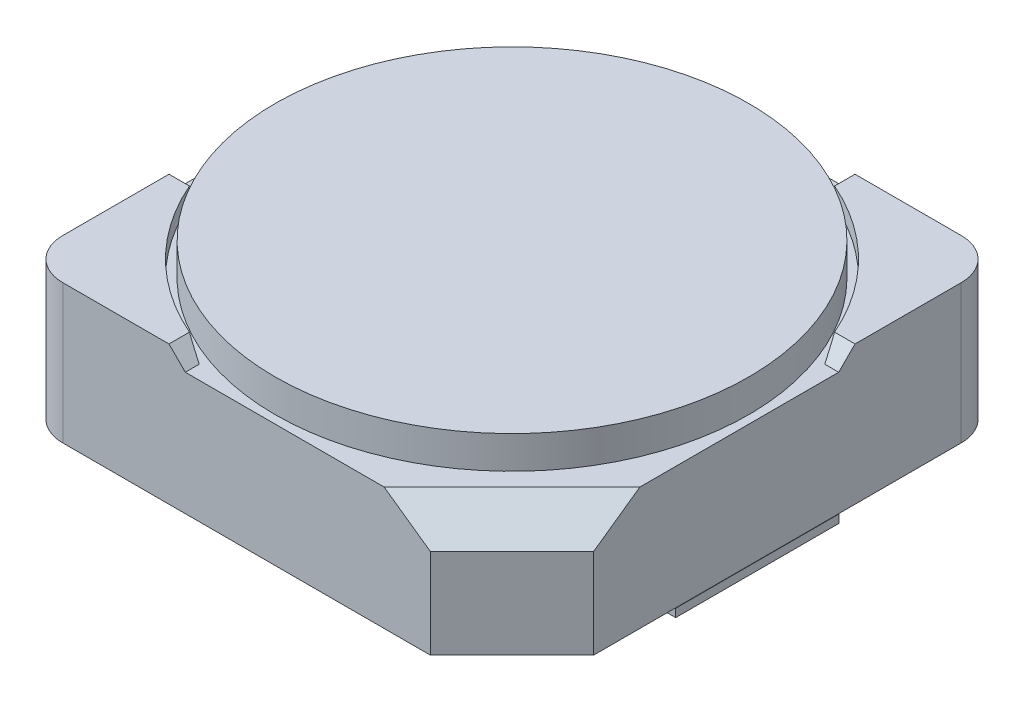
ISO-10303-21;
HEADER;
FILE_DESCRIPTION(('STEP AP214'),'2;1');
FILE_NAME('part.step','',(''),(''),'','','');
FILE_SCHEMA(('AUTOMOTIVE_DESIGN { 1 0 10303 214 1 1 1 1 }'));
ENDSEC;
DATA;
#1=APPLICATION_CONTEXT('core data for automotive mechanical design processes');
#2=APPLICATION_PROTOCOL_DEFINITION('international standard','automotive_design',2000,#1);
#3=PRODUCT_CONTEXT('',#1,'mechanical');
#4=PRODUCT('Part','Part','',(#3));
#5=PRODUCT_RELATED_PRODUCT_CATEGORY('part','',(#4));
#6=PRODUCT_DEFINITION_FORMATION('','',#4);
#7=PRODUCT_DEFINITION_CONTEXT('part definition',#1,'design');
#8=PRODUCT_DEFINITION('design','',#6,#7);
#9=PRODUCT_DEFINITION_SHAPE('','',#8);
#10=(LENGTH_UNIT() NAMED_UNIT(*) SI_UNIT(.MILLI.,.METRE.));
#11=(NAMED_UNIT(*) PLANE_ANGLE_UNIT() SI_UNIT($,.RADIAN.));
#12=(NAMED_UNIT(*) SI_UNIT($,.STERADIAN.) SOLID_ANGLE_UNIT());
#13=UNCERTAINTY_MEASURE_WITH_UNIT(LENGTH_MEASURE(1.E-05),#10,'distance_accuracy_value','');
#14=(GEOMETRIC_REPRESENTATION_CONTEXT(3) GLOBAL_UNCERTAINTY_ASSIGNED_CONTEXT((#13)) GLOBAL_UNIT_ASSIGNED_CONTEXT((#10,
#11,#12)) REPRESENTATION_CONTEXT('',''));
#15=CARTESIAN_POINT('',(0.,0.,0.));
#16=DIRECTION('',(0.,0.,1.));
#17=DIRECTION('',(1.,0.,0.));
#18=AXIS2_PLACEMENT_3D('',#15,#16,#17);
#19=CARTESIAN_POINT('',(0.00229122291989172,1.6,0.));
#20=DIRECTION('',(0.,1.,0.));
#21=DIRECTION('',(0.,0.,1.));
#22=AXIS2_PLACEMENT_3D('',#19,#20,#21);
#23=PLANE('',#22);
#24=CARTESIAN_POINT('',(0.,1.6,0.));
#25=DIRECTION('',(0.,1.,0.));
#26=DIRECTION('',(0.,0.,1.));
#27=AXIS2_PLACEMENT_3D('',#24,#25,#26);
#28=CIRCLE('',#27,2.9);
#29=CARTESIAN_POINT('',(0.,1.6,2.9));
#30=VERTEX_POINT('',#29);
#31=EDGE_CURVE('E272',#30,#30,#28,.T.);
#32=ORIENTED_EDGE('',*,*,#31,.F.);
#33=EDGE_LOOP('',(#32));
#34=FACE_BOUND('',#33,.T.);
#35=DIRECTION('',(0.,0.,-1.));
#36=VECTOR('',#35,1.);
#37=CARTESIAN_POINT('',(3.,1.6,2.));
#38=LINE('',#37,#36);
#39=CARTESIAN_POINT('',(3.,1.6,1.43431457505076));
#40=VERTEX_POINT('',#39);
#41=CARTESIAN_POINT('',(3.,1.6,-1.00000000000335));
#42=VERTEX_POINT('',#41);
#43=EDGE_CURVE('E284',#40,#42,#38,.T.);
#44=ORIENTED_EDGE('',*,*,#43,.T.);
#45=DIRECTION('',(1.,0.,-5.29548402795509E-13));
#46=VECTOR('',#45,1.);
#47=CARTESIAN_POINT('',(3.,1.6,-1.00000000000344));
#48=LINE('',#47,#46);
#49=CARTESIAN_POINT('',(2.82842712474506,1.6,-1.00000000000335));
#50=VERTEX_POINT('',#49);
#51=EDGE_CURVE('E246',#50,#42,#48,.T.);
#52=ORIENTED_EDGE('',*,*,#51,.F.);
#53=CARTESIAN_POINT('',(0.,1.6,0.));
#54=DIRECTION('',(0.,-1.,0.));
#55=DIRECTION('',(0.,0.,-1.));
#56=AXIS2_PLACEMENT_3D('',#53,#54,#55);
#57=CIRCLE('',#56,3.00000000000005);
#58=CARTESIAN_POINT('',(0.999999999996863,1.6,-2.82842712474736));
#59=VERTEX_POINT('',#58);
#60=EDGE_CURVE('E224',#59,#50,#57,.T.);
#61=ORIENTED_EDGE('',*,*,#60,.F.);
#62=DIRECTION('',(2.0663762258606E-12,0.,1.));
#63=VECTOR('',#62,1.);
#64=CARTESIAN_POINT('',(0.999999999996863,1.6,-2.82842712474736));
#65=LINE('',#64,#63);
#66=CARTESIAN_POINT('',(0.999999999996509,1.6,-3.));
#67=VERTEX_POINT('',#66);
#68=EDGE_CURVE('E249',#67,#59,#65,.T.);
#69=ORIENTED_EDGE('',*,*,#68,.F.);
#70=DIRECTION('',(-1.,0.,0.));
#71=VECTOR('',#70,1.);
#72=CARTESIAN_POINT('',(-2.,1.6,-3.));
#73=LINE('',#72,#71);
#74=CARTESIAN_POINT('',(-1.43431457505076,1.6,-3.));
#75=VERTEX_POINT('',#74);
#76=EDGE_CURVE('E275',#67,#75,#73,.T.);
#77=ORIENTED_EDGE('',*,*,#76,.T.);
#78=DIRECTION('',(-0.707106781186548,0.,0.707106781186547));
#79=VECTOR('',#78,1.);
#80=CARTESIAN_POINT('',(-2.71715728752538,1.6,-1.71715728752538));
#81=LINE('',#80,#79);
#82=CARTESIAN_POINT('',(-3.,1.6,-1.43431457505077));
#83=VERTEX_POINT('',#82);
#84=EDGE_CURVE('E402',#75,#83,#81,.T.);
#85=ORIENTED_EDGE('',*,*,#84,.T.);
#86=DIRECTION('',(0.,0.,1.));
#87=VECTOR('',#86,1.);
#88=CARTESIAN_POINT('',(-3.,1.6,2.5));
#89=LINE('',#88,#87);
#90=CARTESIAN_POINT('',(-3.,1.6,1.00000000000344));
#91=VERTEX_POINT('',#90);
#92=EDGE_CURVE('E279',#83,#91,#89,.T.);
#93=ORIENTED_EDGE('',*,*,#92,.T.);
#94=DIRECTION('',(-1.,0.,5.29548402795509E-13));
#95=VECTOR('',#94,1.);
#96=CARTESIAN_POINT('',(-3.,1.6,1.00000000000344));
#97=LINE('',#96,#95);
#98=CARTESIAN_POINT('',(-2.82842712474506,1.6,1.00000000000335));
#99=VERTEX_POINT('',#98);
#100=EDGE_CURVE('E245',#99,#91,#97,.T.);
#101=ORIENTED_EDGE('',*,*,#100,.F.);
#102=CARTESIAN_POINT('',(0.,1.6,0.));
#103=DIRECTION('',(0.,-1.,0.));
#104=DIRECTION('',(0.,0.,1.));
#105=AXIS2_PLACEMENT_3D('',#102,#103,#104);
#106=CIRCLE('',#105,3.00000000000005);
#107=CARTESIAN_POINT('',(-0.999999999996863,1.6,2.82842712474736));
#108=VERTEX_POINT('',#107);
#109=EDGE_CURVE('E256',#108,#99,#106,.T.);
#110=ORIENTED_EDGE('',*,*,#109,.F.);
#111=DIRECTION('',(-2.0663762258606E-12,0.,-1.));
#112=VECTOR('',#111,1.);
#113=CARTESIAN_POINT('',(-0.999999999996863,1.6,2.82842712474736));
#114=LINE('',#113,#112);
#115=CARTESIAN_POINT('',(-0.999999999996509,1.6,2.99999999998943));
#116=VERTEX_POINT('',#115);
#117=EDGE_CURVE('E268',#116,#108,#114,.T.);
#118=ORIENTED_EDGE('',*,*,#117,.F.);
#119=DIRECTION('',(1.,0.,0.));
#120=VECTOR('',#119,1.);
#121=CARTESIAN_POINT('',(-2.5,1.6,3.));
#122=LINE('',#121,#120);
#123=CARTESIAN_POINT('',(1.43431457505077,1.6,3.));
#124=VERTEX_POINT('',#123);
#125=EDGE_CURVE('E282',#116,#124,#122,.T.);
#126=ORIENTED_EDGE('',*,*,#125,.T.);
#127=DIRECTION('',(0.707106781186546,0.,-0.707106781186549));
#128=VECTOR('',#127,1.);
#129=CARTESIAN_POINT('',(2.71715728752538,1.6,1.71715728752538));
#130=LINE('',#129,#128);
#131=EDGE_CURVE('E392',#124,#40,#130,.T.);
#132=ORIENTED_EDGE('',*,*,#131,.T.);
#133=EDGE_LOOP('',(#44,#52,#61,#69,#77,#85,#93,#101,#110,#118,#126,#132));
#134=FACE_BOUND('',#133,.T.);
#135=ADVANCED_FACE('F36',(#34,#134),#23,.T.);
#136=CARTESIAN_POINT('',(3.,2.,2.));
#137=DIRECTION('',(-1.,0.,0.));
#138=DIRECTION('',(0.,0.,1.));
#139=AXIS2_PLACEMENT_3D('',#136,#137,#138);
#140=PLANE('',#139);
#141=DIRECTION('',(3.57873453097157E-12,0.,-1.));
#142=VECTOR('',#141,1.);
#143=CARTESIAN_POINT('',(3.00000000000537,1.8,-2.49999999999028));
#144=LINE('',#143,#142);
#145=CARTESIAN_POINT('',(3.00000000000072,1.8,-1.20000000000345));
#146=VERTEX_POINT('',#145);
#147=CARTESIAN_POINT('',(3.00000000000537,1.8,-2.49999999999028));
#148=VERTEX_POINT('',#147);
#149=EDGE_CURVE('E216',#146,#148,#144,.T.);
#150=ORIENTED_EDGE('',*,*,#149,.F.);
#151=DIRECTION('',(0.,-0.707106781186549,0.707106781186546));
#152=VECTOR('',#151,1.);
#153=CARTESIAN_POINT('',(3.,1.79999999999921,-1.20000000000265));
#154=LINE('',#153,#152);
#155=EDGE_CURVE('E427',#146,#42,#154,.T.);
#156=ORIENTED_EDGE('',*,*,#155,.T.);
#157=ORIENTED_EDGE('',*,*,#43,.F.);
#158=DIRECTION('',(0.,-0.577350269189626,0.816496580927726));
#159=VECTOR('',#158,1.);
#160=CARTESIAN_POINT('',(3.,1.23150445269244,1.95544597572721));
#161=LINE('',#160,#159);
#162=CARTESIAN_POINT('',(3.,1.2,2.));
#163=VERTEX_POINT('',#162);
#164=EDGE_CURVE('E395',#40,#163,#161,.T.);
#165=ORIENTED_EDGE('',*,*,#164,.T.);
#166=DIRECTION('',(0.,-1.,0.));
#167=VECTOR('',#166,1.);
#168=CARTESIAN_POINT('',(3.,2.,2.));
#169=LINE('',#168,#167);
#170=CARTESIAN_POINT('',(3.,0.1,2.));
#171=VERTEX_POINT('',#170);
#172=EDGE_CURVE('E234',#163,#171,#169,.T.);
#173=ORIENTED_EDGE('',*,*,#172,.T.);
#174=DIRECTION('',(0.,0.,1.));
#175=VECTOR('',#174,1.);
#176=CARTESIAN_POINT('',(3.,0.1,2.));
#177=LINE('',#176,#175);
#178=CARTESIAN_POINT('',(3.,0.1,1.00000000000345));
#179=VERTEX_POINT('',#178);
#180=EDGE_CURVE('E349',#179,#171,#177,.T.);
#181=ORIENTED_EDGE('',*,*,#180,.F.);
#182=CARTESIAN_POINT('',(3.,0.1,-1.00000000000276));
#183=VERTEX_POINT('',#182);
#184=EDGE_CURVE('E352',#183,#179,#177,.T.);
#185=ORIENTED_EDGE('',*,*,#184,.F.);
#186=CARTESIAN_POINT('',(3.,0.1,-2.5));
#187=VERTEX_POINT('',#186);
#188=EDGE_CURVE('E230',#187,#183,#177,.T.);
#189=ORIENTED_EDGE('',*,*,#188,.F.);
#190=DIRECTION('',(0.,-1.,0.));
#191=VECTOR('',#190,1.);
#192=CARTESIAN_POINT('',(3.,2.,-2.5));
#193=LINE('',#192,#191);
#194=EDGE_CURVE('E227',#148,#187,#193,.T.);
#195=ORIENTED_EDGE('',*,*,#194,.F.);
#196=EDGE_LOOP('',(#150,#156,#157,#165,#173,#181,#185,#189,#195));
#197=FACE_BOUND('',#196,.T.);
#198=ADVANCED_FACE('F228',(#197),#140,.F.);
#199=CARTESIAN_POINT('',(2.,2.,3.));
#200=DIRECTION('',(-0.707106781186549,0.,-0.707106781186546));
#201=DIRECTION('',(-0.707106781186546,0.,0.707106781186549));
#202=AXIS2_PLACEMENT_3D('',#199,#200,#201);
#203=PLANE('',#202);
#204=ORIENTED_EDGE('',*,*,#172,.F.);
#205=DIRECTION('',(-0.707106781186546,0.,0.707106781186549));
#206=VECTOR('',#205,1.);
#207=CARTESIAN_POINT('',(2.,1.2,3.));
#208=LINE('',#207,#206);
#209=CARTESIAN_POINT('',(2.,1.2,3.));
#210=VERTEX_POINT('',#209);
#211=EDGE_CURVE('E397',#163,#210,#208,.T.);
#212=ORIENTED_EDGE('',*,*,#211,.T.);
#213=DIRECTION('',(0.,-1.,0.));
#214=VECTOR('',#213,1.);
#215=CARTESIAN_POINT('',(2.,2.,3.));
#216=LINE('',#215,#214);
#217=CARTESIAN_POINT('',(2.,0.1,3.));
#218=VERTEX_POINT('',#217);
#219=EDGE_CURVE('E381',#210,#218,#216,.T.);
#220=ORIENTED_EDGE('',*,*,#219,.T.);
#221=DIRECTION('',(-0.707106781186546,0.,0.707106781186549));
#222=VECTOR('',#221,1.);
#223=CARTESIAN_POINT('',(2.,0.1,3.));
#224=LINE('',#223,#222);
#225=EDGE_CURVE('E351',#171,#218,#224,.T.);
#226=ORIENTED_EDGE('',*,*,#225,.F.);
#227=EDGE_LOOP('',(#204,#212,#220,#226));
#228=FACE_BOUND('',#227,.T.);
#229=ADVANCED_FACE('F493',(#228),#203,.F.);
#230=CARTESIAN_POINT('',(-2.5,2.,3.));
#231=DIRECTION('',(0.,0.,-1.));
#232=DIRECTION('',(-1.,0.,0.));
#233=AXIS2_PLACEMENT_3D('',#230,#231,#232);
#234=PLANE('',#233);
#235=ORIENTED_EDGE('',*,*,#125,.F.);
#236=DIRECTION('',(-0.707106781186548,0.707106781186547,0.));
#237=VECTOR('',#236,1.);
#238=CARTESIAN_POINT('',(-1.19999999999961,1.8000000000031,3.));
#239=LINE('',#238,#237);
#240=CARTESIAN_POINT('',(-1.19999999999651,1.8,2.99999999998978));
#241=VERTEX_POINT('',#240);
#242=EDGE_CURVE('E417',#116,#241,#239,.T.);
#243=ORIENTED_EDGE('',*,*,#242,.T.);
#244=DIRECTION('',(1.,0.,-1.76218993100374E-12));
#245=VECTOR('',#244,1.);
#246=CARTESIAN_POINT('',(-2.50000000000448,1.8,2.99999999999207));
#247=LINE('',#246,#245);
#248=CARTESIAN_POINT('',(-2.50000000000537,1.8,2.99999999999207));
#249=VERTEX_POINT('',#248);
#250=EDGE_CURVE('E259',#249,#241,#247,.T.);
#251=ORIENTED_EDGE('',*,*,#250,.F.);
#252=DIRECTION('',(0.,-1.,0.));
#253=VECTOR('',#252,1.);
#254=CARTESIAN_POINT('',(-2.5,2.,3.));
#255=LINE('',#254,#253);
#256=CARTESIAN_POINT('',(-2.5,0.1,3.));
#257=VERTEX_POINT('',#256);
#258=EDGE_CURVE('E383',#249,#257,#255,.T.);
#259=ORIENTED_EDGE('',*,*,#258,.T.);
#260=DIRECTION('',(-1.,0.,0.));
#261=VECTOR('',#260,1.);
#262=CARTESIAN_POINT('',(-2.5,0.1,3.));
#263=LINE('',#262,#261);
#264=EDGE_CURVE('E355',#218,#257,#263,.T.);
#265=ORIENTED_EDGE('',*,*,#264,.F.);
#266=ORIENTED_EDGE('',*,*,#219,.F.);
#267=DIRECTION('',(-0.816496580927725,0.577350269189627,0.));
#268=VECTOR('',#267,1.);
#269=CARTESIAN_POINT('',(1.95697345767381,1.23042435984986,3.));
#270=LINE('',#269,#268);
#271=EDGE_CURVE('E399',#210,#124,#270,.T.);
#272=ORIENTED_EDGE('',*,*,#271,.T.);
#273=EDGE_LOOP('',(#235,#243,#251,#259,#265,#266,#272));
#274=FACE_BOUND('',#273,.T.);
#275=ADVANCED_FACE('F478',(#274),#234,.F.);
#276=CARTESIAN_POINT('',(-2.5,2.,2.5));
#277=DIRECTION('',(0.,-1.,0.));
#278=DIRECTION('',(0.,0.,-1.));
#279=AXIS2_PLACEMENT_3D('',#276,#277,#278);
#280=CYLINDRICAL_SURFACE('',#279,0.5);
#281=ORIENTED_EDGE('',*,*,#258,.F.);
#282=CARTESIAN_POINT('',(-2.50000000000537,1.8,2.49999999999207));
#283=DIRECTION('',(0.,1.,0.));
#284=DIRECTION('',(0.,0.,1.));
#285=AXIS2_PLACEMENT_3D('',#282,#283,#284);
#286=CIRCLE('',#285,0.5);
#287=CARTESIAN_POINT('',(-3.00000000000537,1.8,2.49999999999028));
#288=VERTEX_POINT('',#287);
#289=EDGE_CURVE('E255',#288,#249,#286,.T.);
#290=ORIENTED_EDGE('',*,*,#289,.F.);
#291=DIRECTION('',(0.,-1.,0.));
#292=VECTOR('',#291,1.);
#293=CARTESIAN_POINT('',(-3.,2.,2.5));
#294=LINE('',#293,#292);
#295=CARTESIAN_POINT('',(-3.,0.1,2.5));
#296=VERTEX_POINT('',#295);
#297=EDGE_CURVE('E385',#288,#296,#294,.T.);
#298=ORIENTED_EDGE('',*,*,#297,.T.);
#299=CARTESIAN_POINT('',(-2.5,0.1,2.5));
#300=DIRECTION('',(0.,-1.,0.));
#301=DIRECTION('',(0.,0.,-1.));
#302=AXIS2_PLACEMENT_3D('',#299,#300,#301);
#303=CIRCLE('',#302,0.5);
#304=EDGE_CURVE('E358',#257,#296,#303,.T.);
#305=ORIENTED_EDGE('',*,*,#304,.F.);
#306=EDGE_LOOP('',(#281,#290,#298,#305));
#307=FACE_BOUND('',#306,.T.);
#308=ADVANCED_FACE('F481',(#307),#280,.T.);
#309=CARTESIAN_POINT('',(-3.,2.,2.5));
#310=DIRECTION('',(1.,0.,0.));
#311=DIRECTION('',(0.,0.,-1.));
#312=AXIS2_PLACEMENT_3D('',#309,#310,#311);
#313=PLANE('',#312);
#314=DIRECTION('',(-3.57873453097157E-12,0.,1.));
#315=VECTOR('',#314,1.);
#316=CARTESIAN_POINT('',(-3.00000000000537,1.8,2.49999999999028));
#317=LINE('',#316,#315);
#318=CARTESIAN_POINT('',(-3.00000000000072,1.8,1.20000000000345));
#319=VERTEX_POINT('',#318);
#320=EDGE_CURVE('E253',#319,#288,#317,.T.);
#321=ORIENTED_EDGE('',*,*,#320,.F.);
#322=DIRECTION('',(0.,-0.707106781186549,-0.707106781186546));
#323=VECTOR('',#322,1.);
#324=CARTESIAN_POINT('',(-3.,1.79999999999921,1.20000000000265));
#325=LINE('',#324,#323);
#326=EDGE_CURVE('E422',#319,#91,#325,.T.);
#327=ORIENTED_EDGE('',*,*,#326,.T.);
#328=ORIENTED_EDGE('',*,*,#92,.F.);
#329=DIRECTION('',(0.,-0.577350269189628,-0.816496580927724));
#330=VECTOR('',#329,1.);
#331=CARTESIAN_POINT('',(-3.,1.23042435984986,-1.95697345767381));
#332=LINE('',#331,#330);
#333=CARTESIAN_POINT('',(-3.,1.2,-2.));
#334=VERTEX_POINT('',#333);
#335=EDGE_CURVE('E405',#83,#334,#332,.T.);
#336=ORIENTED_EDGE('',*,*,#335,.T.);
#337=DIRECTION('',(0.,-1.,0.));
#338=VECTOR('',#337,1.);
#339=CARTESIAN_POINT('',(-3.,2.,-2.));
#340=LINE('',#339,#338);
#341=CARTESIAN_POINT('',(-3.,0.1,-2.));
#342=VERTEX_POINT('',#341);
#343=EDGE_CURVE('E387',#334,#342,#340,.T.);
#344=ORIENTED_EDGE('',*,*,#343,.T.);
#345=DIRECTION('',(0.,0.,-1.));
#346=VECTOR('',#345,1.);
#347=CARTESIAN_POINT('',(-3.,0.1,2.5));
#348=LINE('',#347,#346);
#349=CARTESIAN_POINT('',(-3.,0.1,-1.00000000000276));
#350=VERTEX_POINT('',#349);
#351=EDGE_CURVE('E361',#350,#342,#348,.T.);
#352=ORIENTED_EDGE('',*,*,#351,.F.);
#353=DIRECTION('',(0.,1.,0.));
#354=VECTOR('',#353,1.);
#355=CARTESIAN_POINT('',(-2.99999999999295,0.,-1.00000000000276));
#356=LINE('',#355,#354);
#357=CARTESIAN_POINT('',(-2.99999999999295,0.,-1.00000000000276));
#358=VERTEX_POINT('',#357);
#359=EDGE_CURVE('E339',#358,#350,#356,.T.);
#360=ORIENTED_EDGE('',*,*,#359,.F.);
#361=DIRECTION('',(0.,0.,-1.));
#362=VECTOR('',#361,1.);
#363=CARTESIAN_POINT('',(-2.99999999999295,0.,1.00000000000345));
#364=LINE('',#363,#362);
#365=CARTESIAN_POINT('',(-2.99999999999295,0.,1.00000000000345));
#366=VERTEX_POINT('',#365);
#367=EDGE_CURVE('E322',#366,#358,#364,.T.);
#368=ORIENTED_EDGE('',*,*,#367,.F.);
#369=DIRECTION('',(0.,1.,0.));
#370=VECTOR('',#369,1.);
#371=CARTESIAN_POINT('',(-2.99999999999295,0.,1.00000000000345));
#372=LINE('',#371,#370);
#373=CARTESIAN_POINT('',(-3.,0.1,1.00000000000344));
#374=VERTEX_POINT('',#373);
#375=EDGE_CURVE('E342',#366,#374,#372,.T.);
#376=ORIENTED_EDGE('',*,*,#375,.T.);
#377=EDGE_CURVE('E362',#296,#374,#348,.T.);
#378=ORIENTED_EDGE('',*,*,#377,.F.);
#379=ORIENTED_EDGE('',*,*,#297,.F.);
#380=EDGE_LOOP('',(#321,#327,#328,#336,#344,#352,#360,#368,#376,#378,#379));
#381=FACE_BOUND('',#380,.T.);
#382=ADVANCED_FACE('F459',(#381),#313,.F.);
#383=CARTESIAN_POINT('',(-3.,2.,-2.));
#384=DIRECTION('',(0.707106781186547,0.,0.707106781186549));
#385=DIRECTION('',(0.707106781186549,0.,-0.707106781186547));
#386=AXIS2_PLACEMENT_3D('',#383,#384,#385);
#387=PLANE('',#386);
#388=ORIENTED_EDGE('',*,*,#343,.F.);
#389=DIRECTION('',(0.707106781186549,0.,-0.707106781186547));
#390=VECTOR('',#389,1.);
#391=CARTESIAN_POINT('',(-2.,1.2,-3.));
#392=LINE('',#391,#390);
#393=CARTESIAN_POINT('',(-2.,1.2,-3.));
#394=VERTEX_POINT('',#393);
#395=EDGE_CURVE('E407',#334,#394,#392,.T.);
#396=ORIENTED_EDGE('',*,*,#395,.T.);
#397=DIRECTION('',(0.,-1.,0.));
#398=VECTOR('',#397,1.);
#399=CARTESIAN_POINT('',(-2.,2.,-3.));
#400=LINE('',#399,#398);
#401=CARTESIAN_POINT('',(-2.,0.1,-3.));
#402=VERTEX_POINT('',#401);
#403=EDGE_CURVE('E389',#394,#402,#400,.T.);
#404=ORIENTED_EDGE('',*,*,#403,.T.);
#405=DIRECTION('',(0.707106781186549,0.,-0.707106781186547));
#406=VECTOR('',#405,1.);
#407=CARTESIAN_POINT('',(-3.,0.1,-2.));
#408=LINE('',#407,#406);
#409=EDGE_CURVE('E364',#342,#402,#408,.T.);
#410=ORIENTED_EDGE('',*,*,#409,.F.);
#411=EDGE_LOOP('',(#388,#396,#404,#410));
#412=FACE_BOUND('',#411,.T.);
#413=ADVANCED_FACE('F449',(#412),#387,.F.);
#414=CARTESIAN_POINT('',(-2.,2.,-3.));
#415=DIRECTION('',(0.,0.,1.));
#416=DIRECTION('',(1.,0.,0.));
#417=AXIS2_PLACEMENT_3D('',#414,#415,#416);
#418=PLANE('',#417);
#419=ORIENTED_EDGE('',*,*,#76,.F.);
#420=DIRECTION('',(0.707106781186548,0.707106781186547,0.));
#421=VECTOR('',#420,1.);
#422=CARTESIAN_POINT('',(1.19999999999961,1.8000000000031,-3.));
#423=LINE('',#422,#421);
#424=CARTESIAN_POINT('',(1.19999999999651,1.8,-2.99999999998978));
#425=VERTEX_POINT('',#424);
#426=EDGE_CURVE('E12',#67,#425,#423,.T.);
#427=ORIENTED_EDGE('',*,*,#426,.T.);
#428=DIRECTION('',(-1.,0.,1.76218993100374E-12));
#429=VECTOR('',#428,1.);
#430=CARTESIAN_POINT('',(2.50000000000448,1.8,-2.99999999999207));
#431=LINE('',#430,#429);
#432=CARTESIAN_POINT('',(2.50000000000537,1.8,-2.99999999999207));
#433=VERTEX_POINT('',#432);
#434=EDGE_CURVE('E239',#433,#425,#431,.T.);
#435=ORIENTED_EDGE('',*,*,#434,.F.);
#436=DIRECTION('',(0.,-1.,0.));
#437=VECTOR('',#436,1.);
#438=CARTESIAN_POINT('',(2.5,2.,-3.));
#439=LINE('',#438,#437);
#440=CARTESIAN_POINT('',(2.5,0.1,-3.));
#441=VERTEX_POINT('',#440);
#442=EDGE_CURVE('E238',#433,#441,#439,.T.);
#443=ORIENTED_EDGE('',*,*,#442,.T.);
#444=DIRECTION('',(1.,0.,0.));
#445=VECTOR('',#444,1.);
#446=CARTESIAN_POINT('',(-2.,0.1,-3.));
#447=LINE('',#446,#445);
#448=EDGE_CURVE('E367',#402,#441,#447,.T.);
#449=ORIENTED_EDGE('',*,*,#448,.F.);
#450=ORIENTED_EDGE('',*,*,#403,.F.);
#451=DIRECTION('',(0.816496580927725,0.577350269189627,0.));
#452=VECTOR('',#451,1.);
#453=CARTESIAN_POINT('',(-1.95544597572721,1.23150445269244,-3.));
#454=LINE('',#453,#452);
#455=EDGE_CURVE('E409',#394,#75,#454,.T.);
#456=ORIENTED_EDGE('',*,*,#455,.T.);
#457=EDGE_LOOP('',(#419,#427,#435,#443,#449,#450,#456));
#458=FACE_BOUND('',#457,.T.);
#459=ADVANCED_FACE('F439',(#458),#418,.F.);
#460=CARTESIAN_POINT('',(2.5,2.,-2.5));
#461=DIRECTION('',(0.,-1.,0.));
#462=DIRECTION('',(0.,0.,-1.));
#463=AXIS2_PLACEMENT_3D('',#460,#461,#462);
#464=CYLINDRICAL_SURFACE('',#463,0.5);
#465=ORIENTED_EDGE('',*,*,#442,.F.);
#466=CARTESIAN_POINT('',(2.50000000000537,1.8,-2.49999999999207));
#467=DIRECTION('',(0.,1.,0.));
#468=DIRECTION('',(0.,0.,-1.));
#469=AXIS2_PLACEMENT_3D('',#466,#467,#468);
#470=CIRCLE('',#469,0.5);
#471=EDGE_CURVE('E220',#148,#433,#470,.T.);
#472=ORIENTED_EDGE('',*,*,#471,.F.);
#473=ORIENTED_EDGE('',*,*,#194,.T.);
#474=CARTESIAN_POINT('',(2.5,0.1,-2.5));
#475=DIRECTION('',(0.,-1.,0.));
#476=DIRECTION('',(0.,0.,-1.));
#477=AXIS2_PLACEMENT_3D('',#474,#475,#476);
#478=CIRCLE('',#477,0.5);
#479=EDGE_CURVE('E370',#441,#187,#478,.T.);
#480=ORIENTED_EDGE('',*,*,#479,.F.);
#481=EDGE_LOOP('',(#465,#472,#473,#480));
#482=FACE_BOUND('',#481,.T.);
#483=ADVANCED_FACE('F237',(#482),#464,.T.);
#484=CARTESIAN_POINT('',(0.,0.1,0.));
#485=DIRECTION('',(0.,-1.,0.));
#486=DIRECTION('',(0.,0.,-1.));
#487=AXIS2_PLACEMENT_3D('',#484,#485,#486);
#488=PLANE('',#487);
#489=ORIENTED_EDGE('',*,*,#188,.T.);
#490=DIRECTION('',(1.,0.,0.));
#491=VECTOR('',#490,1.);
#492=CARTESIAN_POINT('',(2.07123151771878,0.1,-1.00000000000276));
#493=LINE('',#492,#491);
#494=CARTESIAN_POINT('',(2.07123151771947,0.1,-1.00000000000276));
#495=VERTEX_POINT('',#494);
#496=EDGE_CURVE('E299',#495,#183,#493,.T.);
#497=ORIENTED_EDGE('',*,*,#496,.F.);
#498=CARTESIAN_POINT('',(0.,0.1,0.));
#499=DIRECTION('',(0.,-1.,0.));
#500=DIRECTION('',(0.,0.,-1.));
#501=AXIS2_PLACEMENT_3D('',#498,#499,#500);
#502=CIRCLE('',#501,2.3);
#503=CARTESIAN_POINT('',(-2.07123151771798,0.1,-1.00000000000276));
#504=VERTEX_POINT('',#503);
#505=EDGE_CURVE('E346',#504,#495,#502,.T.);
#506=ORIENTED_EDGE('',*,*,#505,.F.);
#507=DIRECTION('',(1.,0.,0.));
#508=VECTOR('',#507,1.);
#509=CARTESIAN_POINT('',(-2.99999999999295,0.1,-1.00000000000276));
#510=LINE('',#509,#508);
#511=EDGE_CURVE('E323',#350,#504,#510,.T.);
#512=ORIENTED_EDGE('',*,*,#511,.F.);
#513=ORIENTED_EDGE('',*,*,#351,.T.);
#514=ORIENTED_EDGE('',*,*,#409,.T.);
#515=ORIENTED_EDGE('',*,*,#448,.T.);
#516=ORIENTED_EDGE('',*,*,#479,.T.);
#517=EDGE_LOOP('',(#489,#497,#506,#512,#513,#514,#515,#516));
#518=FACE_BOUND('',#517,.T.);
#519=ADVANCED_FACE('F443',(#518),#488,.T.);
#520=CARTESIAN_POINT('',(2.07123151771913,0.1,1.00000000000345));
#521=VERTEX_POINT('',#520);
#522=CARTESIAN_POINT('',(-2.07123151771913,0.1,1.00000000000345));
#523=VERTEX_POINT('',#522);
#524=EDGE_CURVE('E345',#521,#523,#502,.T.);
#525=ORIENTED_EDGE('',*,*,#524,.F.);
#526=DIRECTION('',(-1.,0.,0.));
#527=VECTOR('',#526,1.);
#528=CARTESIAN_POINT('',(3.00458244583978,0.1,1.00000000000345));
#529=LINE('',#528,#527);
#530=EDGE_CURVE('E304',#179,#521,#529,.T.);
#531=ORIENTED_EDGE('',*,*,#530,.F.);
#532=ORIENTED_EDGE('',*,*,#180,.T.);
#533=ORIENTED_EDGE('',*,*,#225,.T.);
#534=ORIENTED_EDGE('',*,*,#264,.T.);
#535=ORIENTED_EDGE('',*,*,#304,.T.);
#536=ORIENTED_EDGE('',*,*,#377,.T.);
#537=DIRECTION('',(-1.,0.,0.));
#538=VECTOR('',#537,1.);
#539=CARTESIAN_POINT('',(-2.07123151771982,0.1,1.00000000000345));
#540=LINE('',#539,#538);
#541=EDGE_CURVE('E318',#523,#374,#540,.T.);
#542=ORIENTED_EDGE('',*,*,#541,.F.);
#543=EDGE_LOOP('',(#525,#531,#532,#533,#534,#535,#536,#542));
#544=FACE_BOUND('',#543,.T.);
#545=ADVANCED_FACE('F486',(#544),#488,.T.);
#546=CARTESIAN_POINT('',(0.,0.5,0.));
#547=DIRECTION('',(0.,-1.,0.));
#548=DIRECTION('',(0.,0.,-1.));
#549=AXIS2_PLACEMENT_3D('',#546,#547,#548);
#550=CYLINDRICAL_SURFACE('',#549,2.3);
#551=CARTESIAN_POINT('',(0.,0.5,0.));
#552=DIRECTION('',(0.,-1.,0.));
#553=DIRECTION('',(0.,0.,-1.));
#554=AXIS2_PLACEMENT_3D('',#551,#552,#553);
#555=CIRCLE('',#554,2.3);
#556=CARTESIAN_POINT('',(0.,0.5,-2.3));
#557=VERTEX_POINT('',#556);
#558=EDGE_CURVE('E235',#557,#557,#555,.T.);
#559=ORIENTED_EDGE('',*,*,#558,.F.);
#560=EDGE_LOOP('',(#559));
#561=FACE_BOUND('',#560,.T.);
#562=ORIENTED_EDGE('',*,*,#505,.T.);
#563=DIRECTION('',(0.,1.,0.));
#564=VECTOR('',#563,1.);
#565=CARTESIAN_POINT('',(2.07123151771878,0.,-1.00000000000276));
#566=LINE('',#565,#564);
#567=CARTESIAN_POINT('',(2.07123151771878,0.,-1.00000000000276));
#568=VERTEX_POINT('',#567);
#569=EDGE_CURVE('E315',#568,#495,#566,.T.);
#570=ORIENTED_EDGE('',*,*,#569,.F.);
#571=CARTESIAN_POINT('',(3.97685356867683E-13,0.,2.25037002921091E-12));
#572=DIRECTION('',(0.,1.,0.));
#573=DIRECTION('',(0.,0.,-1.));
#574=AXIS2_PLACEMENT_3D('',#571,#572,#573);
#575=CIRCLE('',#574,2.3);
#576=CARTESIAN_POINT('',(2.07123151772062,0.,1.00000000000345));
#577=VERTEX_POINT('',#576);
#578=EDGE_CURVE('E288',#577,#568,#575,.T.);
#579=ORIENTED_EDGE('',*,*,#578,.F.);
#580=DIRECTION('',(0.,1.,0.));
#581=VECTOR('',#580,1.);
#582=CARTESIAN_POINT('',(2.07123151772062,0.,1.00000000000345));
#583=LINE('',#582,#581);
#584=EDGE_CURVE('E298',#577,#521,#583,.T.);
#585=ORIENTED_EDGE('',*,*,#584,.T.);
#586=ORIENTED_EDGE('',*,*,#524,.T.);
#587=DIRECTION('',(0.,1.,0.));
#588=VECTOR('',#587,1.);
#589=CARTESIAN_POINT('',(-2.07123151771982,0.,1.00000000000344));
#590=LINE('',#589,#588);
#591=CARTESIAN_POINT('',(-2.07123151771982,0.,1.00000000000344));
#592=VERTEX_POINT('',#591);
#593=EDGE_CURVE('E329',#592,#523,#590,.T.);
#594=ORIENTED_EDGE('',*,*,#593,.F.);
#595=CARTESIAN_POINT('',(3.97685356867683E-13,0.,2.25037002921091E-12));
#596=DIRECTION('',(0.,1.,0.));
#597=DIRECTION('',(0.,0.,-1.));
#598=AXIS2_PLACEMENT_3D('',#595,#596,#597);
#599=CIRCLE('',#598,2.3);
#600=CARTESIAN_POINT('',(-2.07123151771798,0.,-1.00000000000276));
#601=VERTEX_POINT('',#600);
#602=EDGE_CURVE('E327',#601,#592,#599,.T.);
#603=ORIENTED_EDGE('',*,*,#602,.F.);
#604=DIRECTION('',(0.,1.,0.));
#605=VECTOR('',#604,1.);
#606=CARTESIAN_POINT('',(-2.07123151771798,0.,-1.00000000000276));
#607=LINE('',#606,#605);
#608=EDGE_CURVE('E336',#601,#504,#607,.T.);
#609=ORIENTED_EDGE('',*,*,#608,.T.);
#610=EDGE_LOOP('',(#562,#570,#579,#585,#586,#594,#603,#609));
#611=FACE_BOUND('',#610,.T.);
#612=ADVANCED_FACE('F562',(#561,#611),#550,.F.);
#613=CARTESIAN_POINT('',(0.,0.5,0.));
#614=DIRECTION('',(0.,-1.,0.));
#615=DIRECTION('',(0.,0.,-1.));
#616=AXIS2_PLACEMENT_3D('',#613,#614,#615);
#617=PLANE('',#616);
#618=CARTESIAN_POINT('',(0.,0.5,0.));
#619=DIRECTION('',(0.,-1.,0.));
#620=DIRECTION('',(0.,0.,-1.));
#621=AXIS2_PLACEMENT_3D('',#618,#619,#620);
#622=CIRCLE('',#621,2.);
#623=CARTESIAN_POINT('',(0.,0.5,-2.));
#624=VERTEX_POINT('',#623);
#625=EDGE_CURVE('E373',#624,#624,#622,.T.);
#626=ORIENTED_EDGE('',*,*,#625,.F.);
#627=EDGE_LOOP('',(#626));
#628=FACE_BOUND('',#627,.T.);
#629=ORIENTED_EDGE('',*,*,#558,.T.);
#630=EDGE_LOOP('',(#629));
#631=FACE_BOUND('',#630,.T.);
#632=ADVANCED_FACE('F558',(#628,#631),#617,.T.);
#633=CARTESIAN_POINT('',(0.,0.5,0.));
#634=DIRECTION('',(0.,-1.,0.));
#635=DIRECTION('',(0.,0.,-1.));
#636=AXIS2_PLACEMENT_3D('',#633,#634,#635);
#637=CYLINDRICAL_SURFACE('',#636,2.);
#638=ORIENTED_EDGE('',*,*,#625,.T.);
#639=EDGE_LOOP('',(#638));
#640=FACE_BOUND('',#639,.T.);
#641=CARTESIAN_POINT('',(0.,0.,0.));
#642=DIRECTION('',(0.,-1.,0.));
#643=DIRECTION('',(0.,0.,-1.));
#644=AXIS2_PLACEMENT_3D('',#641,#642,#643);
#645=CIRCLE('',#644,2.);
#646=CARTESIAN_POINT('',(0.,0.,-2.));
#647=VERTEX_POINT('',#646);
#648=EDGE_CURVE('E372',#647,#647,#645,.T.);
#649=ORIENTED_EDGE('',*,*,#648,.F.);
#650=EDGE_LOOP('',(#649));
#651=FACE_BOUND('',#650,.T.);
#652=ADVANCED_FACE('F555',(#640,#651),#637,.T.);
#653=CARTESIAN_POINT('',(2.5,0.,-2.5));
#654=DIRECTION('',(0.,1.,0.));
#655=DIRECTION('',(0.,0.,1.));
#656=AXIS2_PLACEMENT_3D('',#653,#654,#655);
#657=PLANE('',#656);
#658=ORIENTED_EDGE('',*,*,#648,.T.);
#659=EDGE_LOOP('',(#658));
#660=FACE_BOUND('',#659,.T.);
#661=ADVANCED_FACE('F551',(#660),#657,.F.);
#662=CARTESIAN_POINT('',(-2.07123151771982,0.,1.00000000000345));
#663=DIRECTION('',(0.,0.,-1.));
#664=DIRECTION('',(-1.,0.,0.));
#665=AXIS2_PLACEMENT_3D('',#662,#663,#664);
#666=PLANE('',#665);
#667=ORIENTED_EDGE('',*,*,#541,.T.);
#668=ORIENTED_EDGE('',*,*,#375,.F.);
#669=DIRECTION('',(-1.,0.,0.));
#670=VECTOR('',#669,1.);
#671=CARTESIAN_POINT('',(-2.07123151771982,0.,1.00000000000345));
#672=LINE('',#671,#670);
#673=EDGE_CURVE('E319',#592,#366,#672,.T.);
#674=ORIENTED_EDGE('',*,*,#673,.F.);
#675=ORIENTED_EDGE('',*,*,#593,.T.);
#676=EDGE_LOOP('',(#667,#668,#674,#675));
#677=FACE_BOUND('',#676,.T.);
#678=ADVANCED_FACE('F547',(#677),#666,.F.);
#679=CARTESIAN_POINT('',(-2.99999999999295,0.,-1.00000000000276));
#680=DIRECTION('',(0.,0.,1.));
#681=DIRECTION('',(1.,0.,0.));
#682=AXIS2_PLACEMENT_3D('',#679,#680,#681);
#683=PLANE('',#682);
#684=ORIENTED_EDGE('',*,*,#511,.T.);
#685=ORIENTED_EDGE('',*,*,#608,.F.);
#686=DIRECTION('',(1.,0.,0.));
#687=VECTOR('',#686,1.);
#688=CARTESIAN_POINT('',(-2.99999999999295,0.,-1.00000000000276));
#689=LINE('',#688,#687);
#690=EDGE_CURVE('E325',#358,#601,#689,.T.);
#691=ORIENTED_EDGE('',*,*,#690,.F.);
#692=ORIENTED_EDGE('',*,*,#359,.T.);
#693=EDGE_LOOP('',(#684,#685,#691,#692));
#694=FACE_BOUND('',#693,.T.);
#695=ADVANCED_FACE('F543',(#694),#683,.F.);
#696=CARTESIAN_POINT('',(3.97685356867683E-13,0.,2.25037002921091E-12));
#697=DIRECTION('',(0.,-1.,0.));
#698=DIRECTION('',(0.,0.,-1.));
#699=AXIS2_PLACEMENT_3D('',#696,#697,#698);
#700=PLANE('',#699);
#701=ORIENTED_EDGE('',*,*,#673,.T.);
#702=ORIENTED_EDGE('',*,*,#367,.T.);
#703=ORIENTED_EDGE('',*,*,#690,.T.);
#704=ORIENTED_EDGE('',*,*,#602,.T.);
#705=EDGE_LOOP('',(#701,#702,#703,#704));
#706=FACE_BOUND('',#705,.T.);
#707=ADVANCED_FACE('F529',(#706),#700,.T.);
#708=CARTESIAN_POINT('',(3.97685356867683E-13,0.1,2.25037002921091E-12));
#709=DIRECTION('',(0.,-1.,0.));
#710=DIRECTION('',(0.,0.,-1.));
#711=AXIS2_PLACEMENT_3D('',#708,#709,#710);
#712=PLANE('',#711);
#713=CARTESIAN_POINT('',(3.00458244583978,0.1,-1.00000000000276));
#714=VERTEX_POINT('',#713);
#715=EDGE_CURVE('E287',#183,#714,#493,.T.);
#716=ORIENTED_EDGE('',*,*,#715,.F.);
#717=ORIENTED_EDGE('',*,*,#184,.T.);
#718=CARTESIAN_POINT('',(3.00458244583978,0.1,1.00000000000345));
#719=VERTEX_POINT('',#718);
#720=EDGE_CURVE('E292',#719,#179,#529,.T.);
#721=ORIENTED_EDGE('',*,*,#720,.F.);
#722=DIRECTION('',(0.,0.,1.));
#723=VECTOR('',#722,1.);
#724=CARTESIAN_POINT('',(3.00458244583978,0.1,-1.00000000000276));
#725=LINE('',#724,#723);
#726=EDGE_CURVE('E302',#714,#719,#725,.T.);
#727=ORIENTED_EDGE('',*,*,#726,.F.);
#728=EDGE_LOOP('',(#716,#717,#721,#727));
#729=FACE_BOUND('',#728,.T.);
#730=ADVANCED_FACE('F525',(#729),#712,.F.);
#731=CARTESIAN_POINT('',(2.07123151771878,0.,-1.00000000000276));
#732=DIRECTION('',(0.,0.,1.));
#733=DIRECTION('',(1.,0.,0.));
#734=AXIS2_PLACEMENT_3D('',#731,#732,#733);
#735=PLANE('',#734);
#736=ORIENTED_EDGE('',*,*,#496,.T.);
#737=ORIENTED_EDGE('',*,*,#715,.T.);
#738=DIRECTION('',(0.,1.,0.));
#739=VECTOR('',#738,1.);
#740=CARTESIAN_POINT('',(3.00458244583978,0.,-1.00000000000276));
#741=LINE('',#740,#739);
#742=CARTESIAN_POINT('',(3.00458244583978,0.,-1.00000000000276));
#743=VERTEX_POINT('',#742);
#744=EDGE_CURVE('E312',#743,#714,#741,.T.);
#745=ORIENTED_EDGE('',*,*,#744,.F.);
#746=DIRECTION('',(1.,0.,0.));
#747=VECTOR('',#746,1.);
#748=CARTESIAN_POINT('',(2.07123151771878,0.,-1.00000000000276));
#749=LINE('',#748,#747);
#750=EDGE_CURVE('E291',#568,#743,#749,.T.);
#751=ORIENTED_EDGE('',*,*,#750,.F.);
#752=ORIENTED_EDGE('',*,*,#569,.T.);
#753=EDGE_LOOP('',(#736,#737,#745,#751,#752));
#754=FACE_BOUND('',#753,.T.);
#755=ADVANCED_FACE('F528',(#754),#735,.F.);
#756=CARTESIAN_POINT('',(3.00458244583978,0.,-1.00000000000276));
#757=DIRECTION('',(-1.,0.,0.));
#758=DIRECTION('',(0.,0.,1.));
#759=AXIS2_PLACEMENT_3D('',#756,#757,#758);
#760=PLANE('',#759);
#761=ORIENTED_EDGE('',*,*,#726,.T.);
#762=DIRECTION('',(0.,1.,0.));
#763=VECTOR('',#762,1.);
#764=CARTESIAN_POINT('',(3.00458244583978,0.,1.00000000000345));
#765=LINE('',#764,#763);
#766=CARTESIAN_POINT('',(3.00458244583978,0.,1.00000000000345));
#767=VERTEX_POINT('',#766);
#768=EDGE_CURVE('E309',#767,#719,#765,.T.);
#769=ORIENTED_EDGE('',*,*,#768,.F.);
#770=DIRECTION('',(0.,0.,1.));
#771=VECTOR('',#770,1.);
#772=CARTESIAN_POINT('',(3.00458244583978,0.,-1.00000000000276));
#773=LINE('',#772,#771);
#774=EDGE_CURVE('E294',#743,#767,#773,.T.);
#775=ORIENTED_EDGE('',*,*,#774,.F.);
#776=ORIENTED_EDGE('',*,*,#744,.T.);
#777=EDGE_LOOP('',(#761,#769,#775,#776));
#778=FACE_BOUND('',#777,.T.);
#779=ADVANCED_FACE('F533',(#778),#760,.F.);
#780=CARTESIAN_POINT('',(3.00458244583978,0.,1.00000000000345));
#781=DIRECTION('',(0.,0.,-1.));
#782=DIRECTION('',(-1.,0.,0.));
#783=AXIS2_PLACEMENT_3D('',#780,#781,#782);
#784=PLANE('',#783);
#785=ORIENTED_EDGE('',*,*,#720,.T.);
#786=ORIENTED_EDGE('',*,*,#530,.T.);
#787=ORIENTED_EDGE('',*,*,#584,.F.);
#788=DIRECTION('',(-1.,0.,0.));
#789=VECTOR('',#788,1.);
#790=CARTESIAN_POINT('',(3.00458244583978,0.,1.00000000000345));
#791=LINE('',#790,#789);
#792=EDGE_CURVE('E296',#767,#577,#791,.T.);
#793=ORIENTED_EDGE('',*,*,#792,.F.);
#794=ORIENTED_EDGE('',*,*,#768,.T.);
#795=EDGE_LOOP('',(#785,#786,#787,#793,#794));
#796=FACE_BOUND('',#795,.T.);
#797=ADVANCED_FACE('F523',(#796),#784,.F.);
#798=CARTESIAN_POINT('',(3.97685356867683E-13,0.,2.25037002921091E-12));
#799=DIRECTION('',(0.,-1.,0.));
#800=DIRECTION('',(0.,0.,-1.));
#801=AXIS2_PLACEMENT_3D('',#798,#799,#800);
#802=PLANE('',#801);
#803=ORIENTED_EDGE('',*,*,#578,.T.);
#804=ORIENTED_EDGE('',*,*,#750,.T.);
#805=ORIENTED_EDGE('',*,*,#774,.T.);
#806=ORIENTED_EDGE('',*,*,#792,.T.);
#807=EDGE_LOOP('',(#803,#804,#805,#806));
#808=FACE_BOUND('',#807,.T.);
#809=ADVANCED_FACE('F520',(#808),#802,.T.);
#810=CARTESIAN_POINT('',(0.,1.6,0.));
#811=DIRECTION('',(0.,1.,0.));
#812=DIRECTION('',(0.,0.,1.));
#813=AXIS2_PLACEMENT_3D('',#810,#811,#812);
#814=CYLINDRICAL_SURFACE('',#813,2.9);
#815=ORIENTED_EDGE('',*,*,#31,.T.);
#816=EDGE_LOOP('',(#815));
#817=FACE_BOUND('',#816,.T.);
#818=CARTESIAN_POINT('',(0.,2.,0.));
#819=DIRECTION('',(0.,1.,0.));
#820=DIRECTION('',(0.,0.,1.));
#821=AXIS2_PLACEMENT_3D('',#818,#819,#820);
#822=CIRCLE('',#821,2.9);
#823=CARTESIAN_POINT('',(0.,2.,2.9));
#824=VERTEX_POINT('',#823);
#825=EDGE_CURVE('E265',#824,#824,#822,.T.);
#826=ORIENTED_EDGE('',*,*,#825,.F.);
#827=EDGE_LOOP('',(#826));
#828=FACE_BOUND('',#827,.T.);
#829=ADVANCED_FACE('F518',(#817,#828),#814,.T.);
#830=CARTESIAN_POINT('',(2.5,2.,-2.5));
#831=DIRECTION('',(0.,1.,0.));
#832=DIRECTION('',(0.,0.,1.));
#833=AXIS2_PLACEMENT_3D('',#830,#831,#832);
#834=PLANE('',#833);
#835=ORIENTED_EDGE('',*,*,#825,.T.);
#836=EDGE_LOOP('',(#835));
#837=FACE_BOUND('',#836,.T.);
#838=ADVANCED_FACE('F567',(#837),#834,.T.);
#839=CARTESIAN_POINT('',(2.21830289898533,1.6,2.21601167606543));
#840=DIRECTION('',(0.500000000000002,0.707106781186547,0.499999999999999));
#841=DIRECTION('',(-0.707106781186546,0.,0.707106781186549));
#842=AXIS2_PLACEMENT_3D('',#839,#840,#841);
#843=PLANE('',#842);
#844=ORIENTED_EDGE('',*,*,#271,.F.);
#845=ORIENTED_EDGE('',*,*,#211,.F.);
#846=ORIENTED_EDGE('',*,*,#164,.F.);
#847=ORIENTED_EDGE('',*,*,#131,.F.);
#848=EDGE_LOOP('',(#844,#845,#846,#847));
#849=FACE_BOUND('',#848,.T.);
#850=ADVANCED_FACE('F498',(#849),#843,.T.);
#851=CARTESIAN_POINT('',(-2.21601167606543,1.6,-2.21830289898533));
#852=DIRECTION('',(-0.5,0.707106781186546,-0.500000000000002));
#853=DIRECTION('',(0.707106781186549,0.,-0.707106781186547));
#854=AXIS2_PLACEMENT_3D('',#851,#852,#853);
#855=PLANE('',#854);
#856=ORIENTED_EDGE('',*,*,#455,.F.);
#857=ORIENTED_EDGE('',*,*,#395,.F.);
#858=ORIENTED_EDGE('',*,*,#335,.F.);
#859=ORIENTED_EDGE('',*,*,#84,.F.);
#860=EDGE_LOOP('',(#856,#857,#858,#859));
#861=FACE_BOUND('',#860,.T.);
#862=ADVANCED_FACE('F454',(#861),#855,.T.);
#863=CARTESIAN_POINT('',(0.,1.8,0.));
#864=DIRECTION('',(0.,-1.,0.));
#865=DIRECTION('',(0.,0.,-1.));
#866=AXIS2_PLACEMENT_3D('',#863,#864,#865);
#867=CYLINDRICAL_SURFACE('',#866,3.00000000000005);
#868=ORIENTED_EDGE('',*,*,#109,.T.);
#869=CARTESIAN_POINT('',(0.,0.599999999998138,0.));
#870=DIRECTION('',(-3.7444726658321E-13,0.707106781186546,-0.707106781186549));
#871=DIRECTION('',(-3.74447266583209E-13,-0.707106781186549,-0.707106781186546));
#872=AXIS2_PLACEMENT_3D('',#869,#870,#871);
#873=ELLIPSE('',#872,4.24264068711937,3.00000000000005);
#874=CARTESIAN_POINT('',(-2.74954541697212,1.8,1.20000000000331));
#875=VERTEX_POINT('',#874);
#876=EDGE_CURVE('E424',#99,#875,#873,.T.);
#877=ORIENTED_EDGE('',*,*,#876,.T.);
#878=CARTESIAN_POINT('',(0.,1.8,0.));
#879=DIRECTION('',(0.,-1.,0.));
#880=DIRECTION('',(0.,0.,1.));
#881=AXIS2_PLACEMENT_3D('',#878,#879,#880);
#882=CIRCLE('',#881,3.00000000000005);
#883=CARTESIAN_POINT('',(-1.19999999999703,1.8,2.74954541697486));
#884=VERTEX_POINT('',#883);
#885=EDGE_CURVE('E262',#884,#875,#882,.T.);
#886=ORIENTED_EDGE('',*,*,#885,.F.);
#887=CARTESIAN_POINT('',(0.,0.599999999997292,0.));
#888=DIRECTION('',(0.707106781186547,0.707106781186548,-1.46114864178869E-12));
#889=DIRECTION('',(0.707106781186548,-0.707106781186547,-1.46114864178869E-12));
#890=AXIS2_PLACEMENT_3D('',#887,#888,#889);
#891=ELLIPSE('',#890,4.24264068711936,3.00000000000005);
#892=EDGE_CURVE('E415',#884,#108,#891,.T.);
#893=ORIENTED_EDGE('',*,*,#892,.T.);
#894=EDGE_LOOP('',(#868,#877,#886,#893));
#895=FACE_BOUND('',#894,.T.);
#896=ADVANCED_FACE('F470',(#895),#867,.F.);
#897=CARTESIAN_POINT('',(0.,1.8,0.));
#898=DIRECTION('',(0.,1.,0.));
#899=DIRECTION('',(0.,0.,1.));
#900=AXIS2_PLACEMENT_3D('',#897,#898,#899);
#901=PLANE('',#900);
#902=ORIENTED_EDGE('',*,*,#885,.T.);
#903=DIRECTION('',(-1.,0.,5.29548402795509E-13));
#904=VECTOR('',#903,1.);
#905=CARTESIAN_POINT('',(-2.99999999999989,1.8,1.20000000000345));
#906=LINE('',#905,#904);
#907=EDGE_CURVE('E419',#875,#319,#906,.T.);
#908=ORIENTED_EDGE('',*,*,#907,.T.);
#909=ORIENTED_EDGE('',*,*,#320,.T.);
#910=ORIENTED_EDGE('',*,*,#289,.T.);
#911=ORIENTED_EDGE('',*,*,#250,.T.);
#912=DIRECTION('',(-2.0663762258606E-12,0.,-1.));
#913=VECTOR('',#912,1.);
#914=CARTESIAN_POINT('',(-1.19999999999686,1.8,2.82842712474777));
#915=LINE('',#914,#913);
#916=EDGE_CURVE('E412',#241,#884,#915,.T.);
#917=ORIENTED_EDGE('',*,*,#916,.T.);
#918=EDGE_LOOP('',(#902,#908,#909,#910,#911,#917));
#919=FACE_BOUND('',#918,.T.);
#920=ADVANCED_FACE('F466',(#919),#901,.T.);
#921=CARTESIAN_POINT('',(0.,1.8,0.));
#922=DIRECTION('',(0.,-1.,0.));
#923=DIRECTION('',(0.,0.,-1.));
#924=AXIS2_PLACEMENT_3D('',#921,#922,#923);
#925=CYLINDRICAL_SURFACE('',#924,3.00000000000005);
#926=CARTESIAN_POINT('',(0.,1.8,0.));
#927=DIRECTION('',(0.,-1.,0.));
#928=DIRECTION('',(0.,0.,-1.));
#929=AXIS2_PLACEMENT_3D('',#926,#927,#928);
#930=CIRCLE('',#929,3.00000000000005);
#931=CARTESIAN_POINT('',(1.19999999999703,1.8,-2.74954541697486));
#932=VERTEX_POINT('',#931);
#933=CARTESIAN_POINT('',(2.74954541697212,1.8,-1.20000000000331));
#934=VERTEX_POINT('',#933);
#935=EDGE_CURVE('E241',#932,#934,#930,.T.);
#936=ORIENTED_EDGE('',*,*,#935,.F.);
#937=CARTESIAN_POINT('',(0.,0.599999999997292,0.));
#938=DIRECTION('',(-0.707106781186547,0.707106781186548,1.46114864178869E-12));
#939=DIRECTION('',(-0.707106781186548,-0.707106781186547,1.46114864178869E-12));
#940=AXIS2_PLACEMENT_3D('',#937,#938,#939);
#941=ELLIPSE('',#940,4.24264068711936,3.00000000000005);
#942=EDGE_CURVE('E44',#932,#59,#941,.T.);
#943=ORIENTED_EDGE('',*,*,#942,.T.);
#944=ORIENTED_EDGE('',*,*,#60,.T.);
#945=CARTESIAN_POINT('',(0.,0.599999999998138,0.));
#946=DIRECTION('',(3.7444726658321E-13,0.707106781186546,0.707106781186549));
#947=DIRECTION('',(3.74447266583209E-13,-0.707106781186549,0.707106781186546));
#948=AXIS2_PLACEMENT_3D('',#945,#946,#947);
#949=ELLIPSE('',#948,4.24264068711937,3.00000000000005);
#950=EDGE_CURVE('E429',#50,#934,#949,.T.);
#951=ORIENTED_EDGE('',*,*,#950,.T.);
#952=EDGE_LOOP('',(#936,#943,#944,#951));
#953=FACE_BOUND('',#952,.T.);
#954=ADVANCED_FACE('F436',(#953),#925,.F.);
#955=CARTESIAN_POINT('',(0.,1.8,0.));
#956=DIRECTION('',(0.,1.,0.));
#957=DIRECTION('',(0.,0.,-1.));
#958=AXIS2_PLACEMENT_3D('',#955,#956,#957);
#959=PLANE('',#958);
#960=ORIENTED_EDGE('',*,*,#434,.T.);
#961=DIRECTION('',(2.0663762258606E-12,0.,1.));
#962=VECTOR('',#961,1.);
#963=CARTESIAN_POINT('',(1.19999999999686,1.8,-2.82842712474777));
#964=LINE('',#963,#962);
#965=EDGE_CURVE('E432',#425,#932,#964,.T.);
#966=ORIENTED_EDGE('',*,*,#965,.T.);
#967=ORIENTED_EDGE('',*,*,#935,.T.);
#968=DIRECTION('',(1.,0.,-5.29548402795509E-13));
#969=VECTOR('',#968,1.);
#970=CARTESIAN_POINT('',(2.99999999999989,1.8,-1.20000000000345));
#971=LINE('',#970,#969);
#972=EDGE_CURVE('E222',#934,#146,#971,.T.);
#973=ORIENTED_EDGE('',*,*,#972,.T.);
#974=ORIENTED_EDGE('',*,*,#149,.T.);
#975=ORIENTED_EDGE('',*,*,#471,.T.);
#976=EDGE_LOOP('',(#960,#966,#967,#973,#974,#975));
#977=FACE_BOUND('',#976,.T.);
#978=ADVANCED_FACE('F218',(#977),#959,.T.);
#979=CARTESIAN_POINT('',(-1.20000000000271,1.8,2.47965147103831E-12));
#980=DIRECTION('',(0.707106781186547,0.707106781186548,-1.46114864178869E-12));
#981=DIRECTION('',(2.0663762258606E-12,0.,1.));
#982=AXIS2_PLACEMENT_3D('',#979,#980,#981);
#983=PLANE('',#982);
#984=ORIENTED_EDGE('',*,*,#242,.F.);
#985=ORIENTED_EDGE('',*,*,#117,.T.);
#986=ORIENTED_EDGE('',*,*,#892,.F.);
#987=ORIENTED_EDGE('',*,*,#916,.F.);
#988=EDGE_LOOP('',(#984,#985,#986,#987));
#989=FACE_BOUND('',#988,.T.);
#990=ADVANCED_FACE('F475',(#989),#983,.T.);
#991=CARTESIAN_POINT('',(6.35458083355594E-13,1.8,1.20000000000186));
#992=DIRECTION('',(-3.7444726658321E-13,0.707106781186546,-0.707106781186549));
#993=DIRECTION('',(1.,0.,-5.29548402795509E-13));
#994=AXIS2_PLACEMENT_3D('',#991,#992,#993);
#995=PLANE('',#994);
#996=ORIENTED_EDGE('',*,*,#876,.F.);
#997=ORIENTED_EDGE('',*,*,#100,.T.);
#998=ORIENTED_EDGE('',*,*,#326,.F.);
#999=ORIENTED_EDGE('',*,*,#907,.F.);
#1000=EDGE_LOOP('',(#996,#997,#998,#999));
#1001=FACE_BOUND('',#1000,.T.);
#1002=ADVANCED_FACE('F464',(#1001),#995,.T.);
#1003=CARTESIAN_POINT('',(-6.35458083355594E-13,1.8,-1.20000000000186));
#1004=DIRECTION('',(3.7444726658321E-13,0.707106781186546,0.707106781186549));
#1005=DIRECTION('',(-1.,0.,5.29548402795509E-13));
#1006=AXIS2_PLACEMENT_3D('',#1003,#1004,#1005);
#1007=PLANE('',#1006);
#1008=ORIENTED_EDGE('',*,*,#950,.F.);
#1009=ORIENTED_EDGE('',*,*,#51,.T.);
#1010=ORIENTED_EDGE('',*,*,#155,.F.);
#1011=ORIENTED_EDGE('',*,*,#972,.F.);
#1012=EDGE_LOOP('',(#1008,#1009,#1010,#1011));
#1013=FACE_BOUND('',#1012,.T.);
#1014=ADVANCED_FACE('F501',(#1013),#1007,.T.);
#1015=CARTESIAN_POINT('',(1.20000000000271,1.8,-2.47965147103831E-12));
#1016=DIRECTION('',(-0.707106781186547,0.707106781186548,1.46114864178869E-12));
#1017=DIRECTION('',(-2.0663762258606E-12,0.,-1.));
#1018=AXIS2_PLACEMENT_3D('',#1015,#1016,#1017);
#1019=PLANE('',#1018);
#1020=ORIENTED_EDGE('',*,*,#426,.F.);
#1021=ORIENTED_EDGE('',*,*,#68,.T.);
#1022=ORIENTED_EDGE('',*,*,#942,.F.);
#1023=ORIENTED_EDGE('',*,*,#965,.F.);
#1024=EDGE_LOOP('',(#1020,#1021,#1022,#1023));
#1025=FACE_BOUND('',#1024,.T.);
#1026=ADVANCED_FACE('F38',(#1025),#1019,.T.);
#1027=CLOSED_SHELL('',(#135,#198,#229,#275,#308,#382,#413,#459,#483,#519,#545,#612,#632,#652,
#661,#678,#695,#707,#730,#755,#779,#797,#809,#829,#838,#850,#862,#896,#920,#954,#978,#990,#1002,
#1014,#1026));
#1028=MANIFOLD_SOLID_BREP('B2',#1027);
#1029=ADVANCED_BREP_SHAPE_REPRESENTATION('',(#18,#1028),#14);
#1030=SHAPE_DEFINITION_REPRESENTATION(#9,#1029);
ENDSEC;
END-ISO-10303-21;
